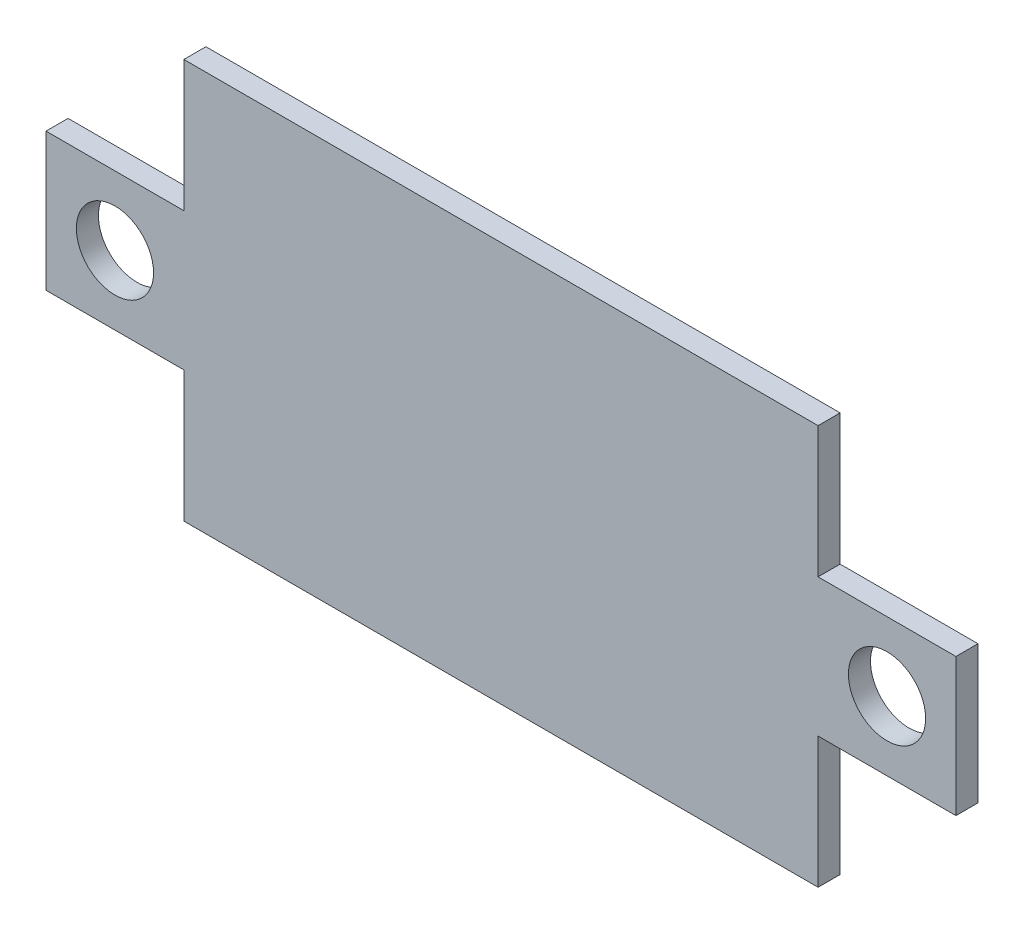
from build123d import *

# Parameters (mm, degrees)
SKETCH1_W           = 23
SKETCH1_H           = 14.5
SKETCH1_W_2         = 5
SKETCH1_H_2         = 5
SKETCH1_R           = 1.4
BOSS_EXTRUDE1_DEPTH = 0.4


with BuildPart() as part:
    # Sketch1 → Boss-Extrude1 (new, symmetric)
    # profile 1 of 3: a face of its own
    with BuildSketch(Plane.XY):
        with Locations((-11.5, -7.25)):
            Rectangle(SKETCH1_W, SKETCH1_H)
    # profile 2 of 3: a face of its own
    with BuildSketch(Plane.XY):
        with Locations((-25.5, -7.25)):
            Rectangle(SKETCH1_W_2, SKETCH1_H_2)
        with Locations((-25.5, -7.25)):
            Circle(SKETCH1_R, mode=Mode.SUBTRACT)
    # profile 3 of 3: a face of its own
    with BuildSketch(Plane.XY):
        with Locations((2.5, -7.25)):
            Rectangle(SKETCH1_W_2, SKETCH1_H_2)
        with Locations((2.5, -7.25)):
            Circle(SKETCH1_R, mode=Mode.SUBTRACT)
    extrude(amount=BOSS_EXTRUDE1_DEPTH, both=True)


solid = part.part
